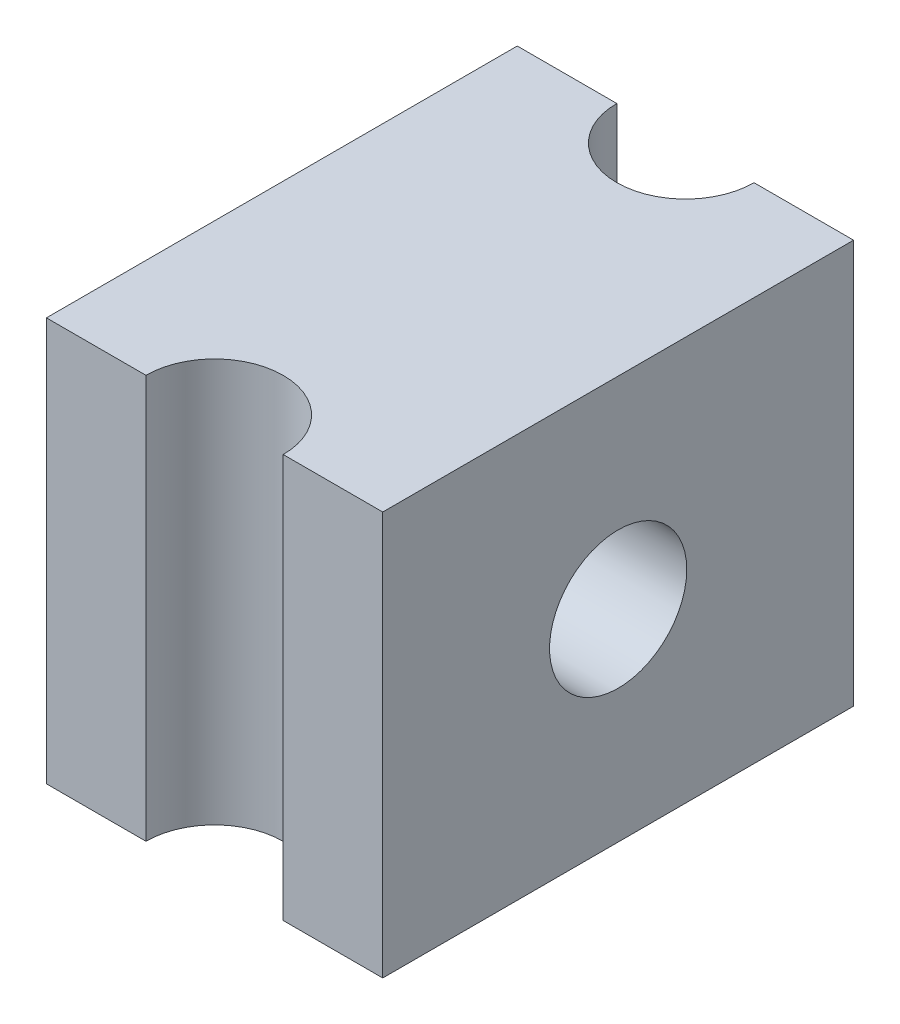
ISO-10303-21;
HEADER;
FILE_DESCRIPTION(('STEP AP214'),'2;1');
FILE_NAME('part.step','',(''),(''),'','','');
FILE_SCHEMA(('AUTOMOTIVE_DESIGN { 1 0 10303 214 1 1 1 1 }'));
ENDSEC;
DATA;
#1=APPLICATION_CONTEXT('core data for automotive mechanical design processes');
#2=APPLICATION_PROTOCOL_DEFINITION('international standard','automotive_design',2000,#1);
#3=PRODUCT_CONTEXT('',#1,'mechanical');
#4=PRODUCT('Part','Part','',(#3));
#5=PRODUCT_RELATED_PRODUCT_CATEGORY('part','',(#4));
#6=PRODUCT_DEFINITION_FORMATION('','',#4);
#7=PRODUCT_DEFINITION_CONTEXT('part definition',#1,'design');
#8=PRODUCT_DEFINITION('design','',#6,#7);
#9=PRODUCT_DEFINITION_SHAPE('','',#8);
#10=(LENGTH_UNIT() NAMED_UNIT(*) SI_UNIT(.MILLI.,.METRE.));
#11=(NAMED_UNIT(*) PLANE_ANGLE_UNIT() SI_UNIT($,.RADIAN.));
#12=(NAMED_UNIT(*) SI_UNIT($,.STERADIAN.) SOLID_ANGLE_UNIT());
#13=UNCERTAINTY_MEASURE_WITH_UNIT(LENGTH_MEASURE(1.E-05),#10,'distance_accuracy_value','');
#14=(GEOMETRIC_REPRESENTATION_CONTEXT(3) GLOBAL_UNCERTAINTY_ASSIGNED_CONTEXT((#13)) GLOBAL_UNIT_ASSIGNED_CONTEXT((#10,
#11,#12)) REPRESENTATION_CONTEXT('',''));
#15=CARTESIAN_POINT('',(0.,0.,0.));
#16=DIRECTION('',(0.,0.,1.));
#17=DIRECTION('',(1.,0.,0.));
#18=AXIS2_PLACEMENT_3D('',#15,#16,#17);
#19=CARTESIAN_POINT('',(25.,15.,-17.5));
#20=DIRECTION('',(0.,0.,1.));
#21=DIRECTION('',(0.,-1.,0.));
#22=AXIS2_PLACEMENT_3D('',#19,#20,#21);
#23=PLANE('',#22);
#24=DIRECTION('',(-1.,0.,0.));
#25=VECTOR('',#24,1.);
#26=CARTESIAN_POINT('',(25.,-15.,-17.5));
#27=LINE('',#26,#25);
#28=CARTESIAN_POINT('',(25.,-15.,-17.5));
#29=VERTEX_POINT('',#28);
#30=CARTESIAN_POINT('',(17.6,-15.,-17.5));
#31=VERTEX_POINT('',#30);
#32=EDGE_CURVE('E121',#29,#31,#27,.T.);
#33=ORIENTED_EDGE('',*,*,#32,.T.);
#34=DIRECTION('',(0.,1.,0.));
#35=VECTOR('',#34,1.);
#36=CARTESIAN_POINT('',(17.6,-15.,-17.5));
#37=LINE('',#36,#35);
#38=CARTESIAN_POINT('',(17.6,15.,-17.5));
#39=VERTEX_POINT('',#38);
#40=EDGE_CURVE('E107',#31,#39,#37,.T.);
#41=ORIENTED_EDGE('',*,*,#40,.T.);
#42=DIRECTION('',(-1.,0.,0.));
#43=VECTOR('',#42,1.);
#44=CARTESIAN_POINT('',(25.,15.,-17.5));
#45=LINE('',#44,#43);
#46=CARTESIAN_POINT('',(25.,15.,-17.5));
#47=VERTEX_POINT('',#46);
#48=EDGE_CURVE('E118',#47,#39,#45,.T.);
#49=ORIENTED_EDGE('',*,*,#48,.F.);
#50=DIRECTION('',(0.,1.,0.));
#51=VECTOR('',#50,1.);
#52=CARTESIAN_POINT('',(25.,15.,-17.5));
#53=LINE('',#52,#51);
#54=EDGE_CURVE('E173',#29,#47,#53,.T.);
#55=ORIENTED_EDGE('',*,*,#54,.F.);
#56=EDGE_LOOP('',(#33,#41,#49,#55));
#57=FACE_BOUND('',#56,.T.);
#58=ADVANCED_FACE('F42',(#57),#23,.F.);
#59=CARTESIAN_POINT('',(25.,15.,17.5));
#60=DIRECTION('',(0.,0.,-1.));
#61=DIRECTION('',(0.,1.,0.));
#62=AXIS2_PLACEMENT_3D('',#59,#60,#61);
#63=PLANE('',#62);
#64=DIRECTION('',(-1.,0.,0.));
#65=VECTOR('',#64,1.);
#66=CARTESIAN_POINT('',(25.,-15.,17.5));
#67=LINE('',#66,#65);
#68=CARTESIAN_POINT('',(7.4,-15.,17.5));
#69=VERTEX_POINT('',#68);
#70=CARTESIAN_POINT('',(0.,-15.,17.5));
#71=VERTEX_POINT('',#70);
#72=EDGE_CURVE('E50',#69,#71,#67,.T.);
#73=ORIENTED_EDGE('',*,*,#72,.F.);
#74=DIRECTION('',(0.,1.,0.));
#75=VECTOR('',#74,1.);
#76=CARTESIAN_POINT('',(7.4,-15.,17.5));
#77=LINE('',#76,#75);
#78=CARTESIAN_POINT('',(7.4,15.,17.5));
#79=VERTEX_POINT('',#78);
#80=EDGE_CURVE('E181',#69,#79,#77,.T.);
#81=ORIENTED_EDGE('',*,*,#80,.T.);
#82=DIRECTION('',(-1.,0.,0.));
#83=VECTOR('',#82,1.);
#84=CARTESIAN_POINT('',(25.,15.,17.5));
#85=LINE('',#84,#83);
#86=CARTESIAN_POINT('',(0.,15.,17.5));
#87=VERTEX_POINT('',#86);
#88=EDGE_CURVE('E156',#79,#87,#85,.T.);
#89=ORIENTED_EDGE('',*,*,#88,.T.);
#90=DIRECTION('',(0.,-1.,0.));
#91=VECTOR('',#90,1.);
#92=CARTESIAN_POINT('',(0.,15.,17.5));
#93=LINE('',#92,#91);
#94=EDGE_CURVE('E150',#87,#71,#93,.T.);
#95=ORIENTED_EDGE('',*,*,#94,.T.);
#96=EDGE_LOOP('',(#73,#81,#89,#95));
#97=FACE_BOUND('',#96,.T.);
#98=ADVANCED_FACE('F154',(#97),#63,.F.);
#99=CARTESIAN_POINT('',(25.,-15.,17.5));
#100=DIRECTION('',(1.,0.,0.));
#101=DIRECTION('',(0.,0.,-1.));
#102=AXIS2_PLACEMENT_3D('',#99,#100,#101);
#103=PLANE('',#102);
#104=DIRECTION('',(0.,-1.,0.));
#105=VECTOR('',#104,1.);
#106=CARTESIAN_POINT('',(25.,15.,17.5));
#107=LINE('',#106,#105);
#108=CARTESIAN_POINT('',(25.,15.,17.5));
#109=VERTEX_POINT('',#108);
#110=CARTESIAN_POINT('',(25.,-15.,17.5));
#111=VERTEX_POINT('',#110);
#112=EDGE_CURVE('E168',#109,#111,#107,.T.);
#113=ORIENTED_EDGE('',*,*,#112,.T.);
#114=DIRECTION('',(0.,0.,-1.));
#115=VECTOR('',#114,1.);
#116=CARTESIAN_POINT('',(25.,-15.,17.5));
#117=LINE('',#116,#115);
#118=EDGE_CURVE('E171',#111,#29,#117,.T.);
#119=ORIENTED_EDGE('',*,*,#118,.T.);
#120=ORIENTED_EDGE('',*,*,#54,.T.);
#121=DIRECTION('',(0.,0.,1.));
#122=VECTOR('',#121,1.);
#123=CARTESIAN_POINT('',(25.,15.,17.5));
#124=LINE('',#123,#122);
#125=EDGE_CURVE('E125',#47,#109,#124,.T.);
#126=ORIENTED_EDGE('',*,*,#125,.T.);
#127=EDGE_LOOP('',(#113,#119,#120,#126));
#128=FACE_BOUND('',#127,.T.);
#129=CARTESIAN_POINT('',(25.,0.,0.));
#130=DIRECTION('',(1.,0.,0.));
#131=DIRECTION('',(0.,0.,-1.));
#132=AXIS2_PLACEMENT_3D('',#129,#130,#131);
#133=CIRCLE('',#132,5.1);
#134=CARTESIAN_POINT('',(25.,0.,-5.09999999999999));
#135=VERTEX_POINT('',#134);
#136=EDGE_CURVE('E158',#135,#135,#133,.T.);
#137=ORIENTED_EDGE('',*,*,#136,.F.);
#138=EDGE_LOOP('',(#137));
#139=FACE_BOUND('',#138,.T.);
#140=ADVANCED_FACE('F207',(#128,#139),#103,.T.);
#141=CARTESIAN_POINT('',(0.,-15.,17.5));
#142=DIRECTION('',(1.,0.,0.));
#143=DIRECTION('',(0.,0.,-1.));
#144=AXIS2_PLACEMENT_3D('',#141,#142,#143);
#145=PLANE('',#144);
#146=ORIENTED_EDGE('',*,*,#94,.F.);
#147=DIRECTION('',(0.,0.,1.));
#148=VECTOR('',#147,1.);
#149=CARTESIAN_POINT('',(0.,15.,17.5));
#150=LINE('',#149,#148);
#151=CARTESIAN_POINT('',(0.,15.,-17.5));
#152=VERTEX_POINT('',#151);
#153=EDGE_CURVE('E166',#152,#87,#150,.T.);
#154=ORIENTED_EDGE('',*,*,#153,.F.);
#155=DIRECTION('',(0.,1.,0.));
#156=VECTOR('',#155,1.);
#157=CARTESIAN_POINT('',(0.,15.,-17.5));
#158=LINE('',#157,#156);
#159=CARTESIAN_POINT('',(0.,-15.,-17.5));
#160=VERTEX_POINT('',#159);
#161=EDGE_CURVE('E152',#160,#152,#158,.T.);
#162=ORIENTED_EDGE('',*,*,#161,.F.);
#163=DIRECTION('',(0.,0.,-1.));
#164=VECTOR('',#163,1.);
#165=CARTESIAN_POINT('',(0.,-15.,17.5));
#166=LINE('',#165,#164);
#167=EDGE_CURVE('E139',#71,#160,#166,.T.);
#168=ORIENTED_EDGE('',*,*,#167,.F.);
#169=EDGE_LOOP('',(#146,#154,#162,#168));
#170=FACE_BOUND('',#169,.T.);
#171=CARTESIAN_POINT('',(0.,0.,0.));
#172=DIRECTION('',(1.,0.,0.));
#173=DIRECTION('',(0.,0.,-1.));
#174=AXIS2_PLACEMENT_3D('',#171,#172,#173);
#175=CIRCLE('',#174,5.1);
#176=CARTESIAN_POINT('',(0.,0.,-5.09999999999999));
#177=VERTEX_POINT('',#176);
#178=EDGE_CURVE('E161',#177,#177,#175,.T.);
#179=ORIENTED_EDGE('',*,*,#178,.T.);
#180=EDGE_LOOP('',(#179));
#181=FACE_BOUND('',#180,.T.);
#182=ADVANCED_FACE('F147',(#170,#181),#145,.F.);
#183=CARTESIAN_POINT('',(17.6,15.,17.5));
#184=VERTEX_POINT('',#183);
#185=EDGE_CURVE('E129',#109,#184,#85,.T.);
#186=ORIENTED_EDGE('',*,*,#185,.T.);
#187=DIRECTION('',(0.,1.,0.));
#188=VECTOR('',#187,1.);
#189=CARTESIAN_POINT('',(17.6,-15.,17.5));
#190=LINE('',#189,#188);
#191=CARTESIAN_POINT('',(17.6,-15.,17.5));
#192=VERTEX_POINT('',#191);
#193=EDGE_CURVE('E65',#192,#184,#190,.T.);
#194=ORIENTED_EDGE('',*,*,#193,.F.);
#195=EDGE_CURVE('E13',#111,#192,#67,.T.);
#196=ORIENTED_EDGE('',*,*,#195,.F.);
#197=ORIENTED_EDGE('',*,*,#112,.F.);
#198=EDGE_LOOP('',(#186,#194,#196,#197));
#199=FACE_BOUND('',#198,.T.);
#200=ADVANCED_FACE('F44',(#199),#63,.F.);
#201=CARTESIAN_POINT('',(25.,-15.,17.5));
#202=DIRECTION('',(0.,1.,0.));
#203=DIRECTION('',(0.,0.,1.));
#204=AXIS2_PLACEMENT_3D('',#201,#202,#203);
#205=PLANE('',#204);
#206=CARTESIAN_POINT('',(7.4,-15.,-17.5));
#207=VERTEX_POINT('',#206);
#208=EDGE_CURVE('E126',#207,#160,#27,.T.);
#209=ORIENTED_EDGE('',*,*,#208,.F.);
#210=CARTESIAN_POINT('',(12.5,-15.,-17.5));
#211=DIRECTION('',(0.,1.,0.));
#212=DIRECTION('',(0.,0.,1.));
#213=AXIS2_PLACEMENT_3D('',#210,#211,#212);
#214=CIRCLE('',#213,5.1);
#215=EDGE_CURVE('E112',#207,#31,#214,.T.);
#216=ORIENTED_EDGE('',*,*,#215,.T.);
#217=ORIENTED_EDGE('',*,*,#32,.F.);
#218=ORIENTED_EDGE('',*,*,#118,.F.);
#219=ORIENTED_EDGE('',*,*,#195,.T.);
#220=CARTESIAN_POINT('',(12.5,-15.,17.5));
#221=DIRECTION('',(0.,1.,0.));
#222=DIRECTION('',(0.,0.,1.));
#223=AXIS2_PLACEMENT_3D('',#220,#221,#222);
#224=CIRCLE('',#223,5.1);
#225=EDGE_CURVE('E141',#192,#69,#224,.T.);
#226=ORIENTED_EDGE('',*,*,#225,.T.);
#227=ORIENTED_EDGE('',*,*,#72,.T.);
#228=ORIENTED_EDGE('',*,*,#167,.T.);
#229=EDGE_LOOP('',(#209,#216,#217,#218,#219,#226,#227,#228));
#230=FACE_BOUND('',#229,.T.);
#231=ADVANCED_FACE('F138',(#230),#205,.F.);
#232=CARTESIAN_POINT('',(7.4,15.,-17.5));
#233=VERTEX_POINT('',#232);
#234=EDGE_CURVE('E127',#233,#152,#45,.T.);
#235=ORIENTED_EDGE('',*,*,#234,.F.);
#236=DIRECTION('',(0.,1.,0.));
#237=VECTOR('',#236,1.);
#238=CARTESIAN_POINT('',(7.4,-15.,-17.5));
#239=LINE('',#238,#237);
#240=EDGE_CURVE('E57',#207,#233,#239,.T.);
#241=ORIENTED_EDGE('',*,*,#240,.F.);
#242=ORIENTED_EDGE('',*,*,#208,.T.);
#243=ORIENTED_EDGE('',*,*,#161,.T.);
#244=EDGE_LOOP('',(#235,#241,#242,#243));
#245=FACE_BOUND('',#244,.T.);
#246=ADVANCED_FACE('F199',(#245),#23,.F.);
#247=CARTESIAN_POINT('',(25.,15.,17.5));
#248=DIRECTION('',(0.,-1.,0.));
#249=DIRECTION('',(0.,0.,-1.));
#250=AXIS2_PLACEMENT_3D('',#247,#248,#249);
#251=PLANE('',#250);
#252=ORIENTED_EDGE('',*,*,#48,.T.);
#253=CARTESIAN_POINT('',(12.5,15.,-17.5));
#254=DIRECTION('',(0.,1.,0.));
#255=DIRECTION('',(0.,0.,1.));
#256=AXIS2_PLACEMENT_3D('',#253,#254,#255);
#257=CIRCLE('',#256,5.1);
#258=EDGE_CURVE('E104',#233,#39,#257,.T.);
#259=ORIENTED_EDGE('',*,*,#258,.F.);
#260=ORIENTED_EDGE('',*,*,#234,.T.);
#261=ORIENTED_EDGE('',*,*,#153,.T.);
#262=ORIENTED_EDGE('',*,*,#88,.F.);
#263=CARTESIAN_POINT('',(12.5,15.,17.5));
#264=DIRECTION('',(0.,1.,0.));
#265=DIRECTION('',(0.,0.,1.));
#266=AXIS2_PLACEMENT_3D('',#263,#264,#265);
#267=CIRCLE('',#266,5.1);
#268=EDGE_CURVE('E179',#184,#79,#267,.T.);
#269=ORIENTED_EDGE('',*,*,#268,.F.);
#270=ORIENTED_EDGE('',*,*,#185,.F.);
#271=ORIENTED_EDGE('',*,*,#125,.F.);
#272=EDGE_LOOP('',(#252,#259,#260,#261,#262,#269,#270,#271));
#273=FACE_BOUND('',#272,.T.);
#274=ADVANCED_FACE('F123',(#273),#251,.F.);
#275=CARTESIAN_POINT('',(25.,0.,0.));
#276=DIRECTION('',(-1.,0.,0.));
#277=DIRECTION('',(0.,0.,1.));
#278=AXIS2_PLACEMENT_3D('',#275,#276,#277);
#279=CYLINDRICAL_SURFACE('',#278,5.1);
#280=ORIENTED_EDGE('',*,*,#136,.T.);
#281=EDGE_LOOP('',(#280));
#282=FACE_BOUND('',#281,.T.);
#283=ORIENTED_EDGE('',*,*,#178,.F.);
#284=EDGE_LOOP('',(#283));
#285=FACE_BOUND('',#284,.T.);
#286=ADVANCED_FACE('F189',(#282,#285),#279,.F.);
#287=CARTESIAN_POINT('',(12.5,-15.,17.5));
#288=DIRECTION('',(0.,1.,0.));
#289=DIRECTION('',(0.,0.,1.));
#290=AXIS2_PLACEMENT_3D('',#287,#288,#289);
#291=CYLINDRICAL_SURFACE('',#290,5.1);
#292=ORIENTED_EDGE('',*,*,#268,.T.);
#293=ORIENTED_EDGE('',*,*,#80,.F.);
#294=ORIENTED_EDGE('',*,*,#225,.F.);
#295=ORIENTED_EDGE('',*,*,#193,.T.);
#296=EDGE_LOOP('',(#292,#293,#294,#295));
#297=FACE_BOUND('',#296,.T.);
#298=ADVANCED_FACE('F191',(#297),#291,.F.);
#299=CARTESIAN_POINT('',(12.5,-15.,-17.5));
#300=DIRECTION('',(0.,1.,0.));
#301=DIRECTION('',(0.,0.,1.));
#302=AXIS2_PLACEMENT_3D('',#299,#300,#301);
#303=CYLINDRICAL_SURFACE('',#302,5.1);
#304=ORIENTED_EDGE('',*,*,#258,.T.);
#305=ORIENTED_EDGE('',*,*,#40,.F.);
#306=ORIENTED_EDGE('',*,*,#215,.F.);
#307=ORIENTED_EDGE('',*,*,#240,.T.);
#308=EDGE_LOOP('',(#304,#305,#306,#307));
#309=FACE_BOUND('',#308,.T.);
#310=ADVANCED_FACE('F106',(#309),#303,.F.);
#311=CLOSED_SHELL('',(#58,#98,#140,#182,#200,#231,#246,#274,#286,#298,#310));
#312=MANIFOLD_SOLID_BREP('B2',#311);
#313=ADVANCED_BREP_SHAPE_REPRESENTATION('',(#18,#312),#14);
#314=SHAPE_DEFINITION_REPRESENTATION(#9,#313);
ENDSEC;
END-ISO-10303-21;
